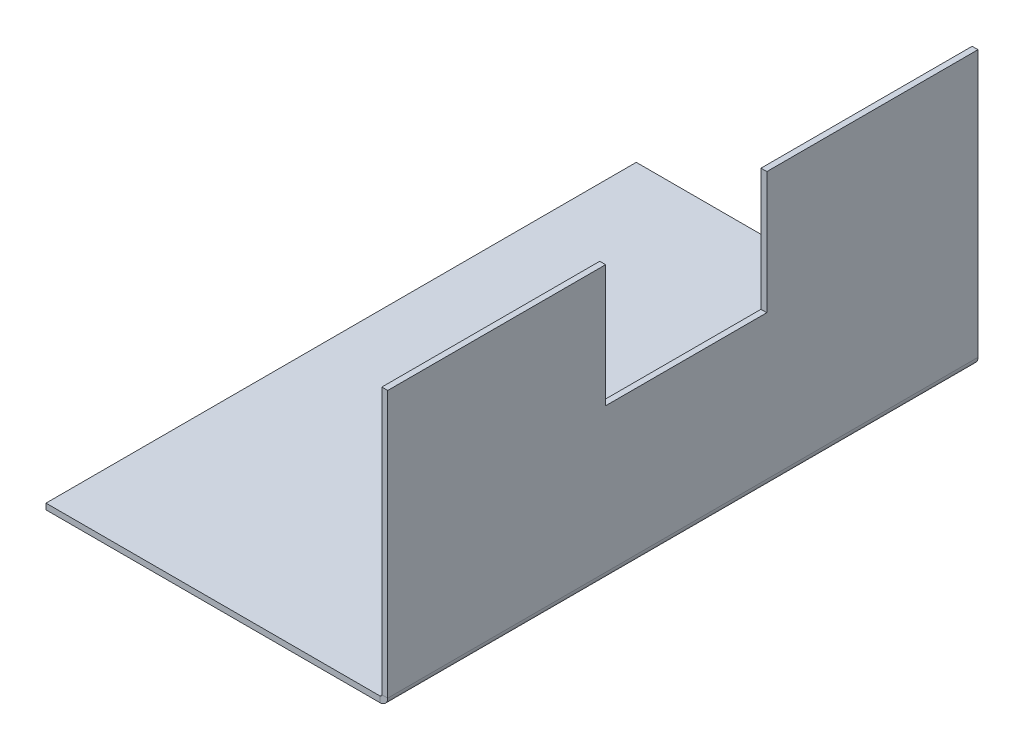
ISO-10303-21;
HEADER;
FILE_DESCRIPTION(('STEP AP214'),'2;1');
FILE_NAME('part.step','',(''),(''),'','','');
FILE_SCHEMA(('AUTOMOTIVE_DESIGN { 1 0 10303 214 1 1 1 1 }'));
ENDSEC;
DATA;
#1=APPLICATION_CONTEXT('core data for automotive mechanical design processes');
#2=APPLICATION_PROTOCOL_DEFINITION('international standard','automotive_design',2000,#1);
#3=PRODUCT_CONTEXT('',#1,'mechanical');
#4=PRODUCT('Part','Part','',(#3));
#5=PRODUCT_RELATED_PRODUCT_CATEGORY('part','',(#4));
#6=PRODUCT_DEFINITION_FORMATION('','',#4);
#7=PRODUCT_DEFINITION_CONTEXT('part definition',#1,'design');
#8=PRODUCT_DEFINITION('design','',#6,#7);
#9=PRODUCT_DEFINITION_SHAPE('','',#8);
#10=(LENGTH_UNIT() NAMED_UNIT(*) SI_UNIT(.MILLI.,.METRE.));
#11=(NAMED_UNIT(*) PLANE_ANGLE_UNIT() SI_UNIT($,.RADIAN.));
#12=(NAMED_UNIT(*) SI_UNIT($,.STERADIAN.) SOLID_ANGLE_UNIT());
#13=UNCERTAINTY_MEASURE_WITH_UNIT(LENGTH_MEASURE(1.E-05),#10,'distance_accuracy_value','');
#14=(GEOMETRIC_REPRESENTATION_CONTEXT(3) GLOBAL_UNCERTAINTY_ASSIGNED_CONTEXT((#13)) GLOBAL_UNIT_ASSIGNED_CONTEXT((#10,
#11,#12)) REPRESENTATION_CONTEXT('',''));
#15=CARTESIAN_POINT('',(0.,0.,0.));
#16=DIRECTION('',(0.,0.,1.));
#17=DIRECTION('',(1.,0.,0.));
#18=AXIS2_PLACEMENT_3D('',#15,#16,#17);
#19=CARTESIAN_POINT('',(0.,0.762,0.));
#20=DIRECTION('',(0.,0.,-1.));
#21=DIRECTION('',(-1.,0.,0.));
#22=AXIS2_PLACEMENT_3D('',#19,#20,#21);
#23=PLANE('',#22);
#24=DIRECTION('',(0.,-1.,0.));
#25=VECTOR('',#24,1.);
#26=CARTESIAN_POINT('',(43.2845731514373,0.761999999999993,0.));
#27=LINE('',#26,#25);
#28=CARTESIAN_POINT('',(43.2845731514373,0.762,0.));
#29=VERTEX_POINT('',#28);
#30=CARTESIAN_POINT('',(43.2845731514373,0.,0.));
#31=VERTEX_POINT('',#30);
#32=EDGE_CURVE('E51',#29,#31,#27,.T.);
#33=ORIENTED_EDGE('',*,*,#32,.F.);
#34=DIRECTION('',(1.,0.,0.));
#35=VECTOR('',#34,1.);
#36=CARTESIAN_POINT('',(0.,0.762,0.));
#37=LINE('',#36,#35);
#38=CARTESIAN_POINT('',(0.,0.762,0.));
#39=VERTEX_POINT('',#38);
#40=EDGE_CURVE('E205',#39,#29,#37,.T.);
#41=ORIENTED_EDGE('',*,*,#40,.F.);
#42=DIRECTION('',(0.,-1.,0.));
#43=VECTOR('',#42,1.);
#44=CARTESIAN_POINT('',(0.,0.762,0.));
#45=LINE('',#44,#43);
#46=CARTESIAN_POINT('',(0.,0.,0.));
#47=VERTEX_POINT('',#46);
#48=EDGE_CURVE('E11',#39,#47,#45,.T.);
#49=ORIENTED_EDGE('',*,*,#48,.T.);
#50=DIRECTION('',(1.,0.,0.));
#51=VECTOR('',#50,1.);
#52=CARTESIAN_POINT('',(0.,0.,0.));
#53=LINE('',#52,#51);
#54=EDGE_CURVE('E198',#47,#31,#53,.T.);
#55=ORIENTED_EDGE('',*,*,#54,.T.);
#56=EDGE_LOOP('',(#33,#41,#49,#55));
#57=FACE_BOUND('',#56,.T.);
#58=ADVANCED_FACE('F28',(#57),#23,.F.);
#59=CARTESIAN_POINT('',(0.,0.762,-76.5167255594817));
#60=DIRECTION('',(0.,0.,1.));
#61=DIRECTION('',(1.,0.,0.));
#62=AXIS2_PLACEMENT_3D('',#59,#60,#61);
#63=PLANE('',#62);
#64=DIRECTION('',(0.,-1.,0.));
#65=VECTOR('',#64,1.);
#66=CARTESIAN_POINT('',(43.2845731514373,0.761999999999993,-76.5167255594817));
#67=LINE('',#66,#65);
#68=CARTESIAN_POINT('',(43.2845731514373,0.762,-76.5167255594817));
#69=VERTEX_POINT('',#68);
#70=CARTESIAN_POINT('',(43.2845731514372,0.,-76.5167255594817));
#71=VERTEX_POINT('',#70);
#72=EDGE_CURVE('E191',#69,#71,#67,.T.);
#73=ORIENTED_EDGE('',*,*,#72,.T.);
#74=DIRECTION('',(-1.,0.,0.));
#75=VECTOR('',#74,1.);
#76=CARTESIAN_POINT('',(0.,0.,-76.5167255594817));
#77=LINE('',#76,#75);
#78=CARTESIAN_POINT('',(0.,0.,-76.5167255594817));
#79=VERTEX_POINT('',#78);
#80=EDGE_CURVE('E200',#71,#79,#77,.T.);
#81=ORIENTED_EDGE('',*,*,#80,.T.);
#82=DIRECTION('',(0.,-1.,0.));
#83=VECTOR('',#82,1.);
#84=CARTESIAN_POINT('',(0.,0.762,-76.5167255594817));
#85=LINE('',#84,#83);
#86=CARTESIAN_POINT('',(0.,0.762,-76.5167255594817));
#87=VERTEX_POINT('',#86);
#88=EDGE_CURVE('E36',#87,#79,#85,.T.);
#89=ORIENTED_EDGE('',*,*,#88,.F.);
#90=DIRECTION('',(-1.,0.,0.));
#91=VECTOR('',#90,1.);
#92=CARTESIAN_POINT('',(0.,0.762,-76.5167255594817));
#93=LINE('',#92,#91);
#94=EDGE_CURVE('E207',#69,#87,#93,.T.);
#95=ORIENTED_EDGE('',*,*,#94,.F.);
#96=EDGE_LOOP('',(#73,#81,#89,#95));
#97=FACE_BOUND('',#96,.T.);
#98=ADVANCED_FACE('F219',(#97),#63,.F.);
#99=CARTESIAN_POINT('',(0.,0.762,0.));
#100=DIRECTION('',(0.,1.,0.));
#101=DIRECTION('',(0.,0.,1.));
#102=AXIS2_PLACEMENT_3D('',#99,#100,#101);
#103=PLANE('',#102);
#104=ORIENTED_EDGE('',*,*,#40,.T.);
#105=DIRECTION('',(0.,0.,-1.));
#106=VECTOR('',#105,1.);
#107=CARTESIAN_POINT('',(43.2845731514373,0.761999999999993,-76.5167255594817));
#108=LINE('',#107,#106);
#109=EDGE_CURVE('E43',#69,#29,#108,.F.);
#110=ORIENTED_EDGE('',*,*,#109,.F.);
#111=ORIENTED_EDGE('',*,*,#94,.T.);
#112=DIRECTION('',(0.,0.,1.));
#113=VECTOR('',#112,1.);
#114=CARTESIAN_POINT('',(0.,0.762,-76.5167255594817));
#115=LINE('',#114,#113);
#116=EDGE_CURVE('E202',#87,#39,#115,.T.);
#117=ORIENTED_EDGE('',*,*,#116,.T.);
#118=EDGE_LOOP('',(#104,#110,#111,#117));
#119=FACE_BOUND('',#118,.T.);
#120=ADVANCED_FACE('F218',(#119),#103,.T.);
#121=CARTESIAN_POINT('',(0.,0.,0.));
#122=DIRECTION('',(0.,1.,0.));
#123=DIRECTION('',(0.,0.,1.));
#124=AXIS2_PLACEMENT_3D('',#121,#122,#123);
#125=PLANE('',#124);
#126=DIRECTION('',(0.,0.,-1.));
#127=VECTOR('',#126,1.);
#128=CARTESIAN_POINT('',(43.2845731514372,0.,-76.5167255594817));
#129=LINE('',#128,#127);
#130=EDGE_CURVE('E125',#71,#31,#129,.F.);
#131=ORIENTED_EDGE('',*,*,#130,.T.);
#132=ORIENTED_EDGE('',*,*,#54,.F.);
#133=DIRECTION('',(0.,0.,1.));
#134=VECTOR('',#133,1.);
#135=CARTESIAN_POINT('',(0.,0.,-76.5167255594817));
#136=LINE('',#135,#134);
#137=EDGE_CURVE('E194',#79,#47,#136,.T.);
#138=ORIENTED_EDGE('',*,*,#137,.F.);
#139=ORIENTED_EDGE('',*,*,#80,.F.);
#140=EDGE_LOOP('',(#131,#132,#138,#139));
#141=FACE_BOUND('',#140,.T.);
#142=ADVANCED_FACE('F217',(#141),#125,.F.);
#143=CARTESIAN_POINT('',(0.,0.762,-76.5167255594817));
#144=DIRECTION('',(1.,0.,0.));
#145=DIRECTION('',(0.,0.,-1.));
#146=AXIS2_PLACEMENT_3D('',#143,#144,#145);
#147=PLANE('',#146);
#148=ORIENTED_EDGE('',*,*,#137,.T.);
#149=ORIENTED_EDGE('',*,*,#48,.F.);
#150=ORIENTED_EDGE('',*,*,#116,.F.);
#151=ORIENTED_EDGE('',*,*,#88,.T.);
#152=EDGE_LOOP('',(#148,#149,#150,#151));
#153=FACE_BOUND('',#152,.T.);
#154=ADVANCED_FACE('F30',(#153),#147,.F.);
#155=CARTESIAN_POINT('',(43.2845731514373,1.016,0.));
#156=DIRECTION('',(0.,0.,1.));
#157=DIRECTION('',(1.,0.,0.));
#158=AXIS2_PLACEMENT_3D('',#155,#156,#157);
#159=PLANE('',#158);
#160=DIRECTION('',(1.,0.,0.));
#161=VECTOR('',#160,1.);
#162=CARTESIAN_POINT('',(43.5385731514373,1.016,0.));
#163=LINE('',#162,#161);
#164=CARTESIAN_POINT('',(43.5385731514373,1.016,0.));
#165=VERTEX_POINT('',#164);
#166=CARTESIAN_POINT('',(44.3005731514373,1.01599999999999,0.));
#167=VERTEX_POINT('',#166);
#168=EDGE_CURVE('E227',#165,#167,#163,.T.);
#169=ORIENTED_EDGE('',*,*,#168,.F.);
#170=CARTESIAN_POINT('',(43.2845731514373,1.016,0.));
#171=DIRECTION('',(0.,0.,-1.));
#172=DIRECTION('',(-1.,0.,0.));
#173=AXIS2_PLACEMENT_3D('',#170,#171,#172);
#174=CIRCLE('',#173,0.254000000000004);
#175=EDGE_CURVE('E128',#29,#165,#174,.F.);
#176=ORIENTED_EDGE('',*,*,#175,.F.);
#177=ORIENTED_EDGE('',*,*,#32,.T.);
#178=CARTESIAN_POINT('',(43.2845731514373,1.016,0.));
#179=DIRECTION('',(0.,0.,-1.));
#180=DIRECTION('',(-1.,0.,0.));
#181=AXIS2_PLACEMENT_3D('',#178,#179,#180);
#182=CIRCLE('',#181,1.016);
#183=EDGE_CURVE('E190',#31,#167,#182,.F.);
#184=ORIENTED_EDGE('',*,*,#183,.T.);
#185=EDGE_LOOP('',(#169,#176,#177,#184));
#186=FACE_BOUND('',#185,.T.);
#187=ADVANCED_FACE('F277',(#186),#159,.T.);
#188=CARTESIAN_POINT('',(43.2845731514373,1.016,-76.5167255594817));
#189=DIRECTION('',(0.,0.,1.));
#190=DIRECTION('',(1.,0.,0.));
#191=AXIS2_PLACEMENT_3D('',#188,#189,#190);
#192=PLANE('',#191);
#193=CARTESIAN_POINT('',(43.2845731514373,1.016,-76.5167255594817));
#194=DIRECTION('',(0.,0.,-1.));
#195=DIRECTION('',(-1.,0.,0.));
#196=AXIS2_PLACEMENT_3D('',#193,#194,#195);
#197=CIRCLE('',#196,0.254000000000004);
#198=CARTESIAN_POINT('',(43.5385731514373,1.016,-76.5167255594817));
#199=VERTEX_POINT('',#198);
#200=EDGE_CURVE('E135',#199,#69,#197,.T.);
#201=ORIENTED_EDGE('',*,*,#200,.F.);
#202=DIRECTION('',(1.,0.,0.));
#203=VECTOR('',#202,1.);
#204=CARTESIAN_POINT('',(43.5385731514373,1.016,-76.5167255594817));
#205=LINE('',#204,#203);
#206=CARTESIAN_POINT('',(44.3005731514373,1.01599999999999,-76.5167255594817));
#207=VERTEX_POINT('',#206);
#208=EDGE_CURVE('E132',#199,#207,#205,.T.);
#209=ORIENTED_EDGE('',*,*,#208,.T.);
#210=CARTESIAN_POINT('',(43.2845731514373,1.016,-76.5167255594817));
#211=DIRECTION('',(0.,0.,-1.));
#212=DIRECTION('',(-1.,0.,0.));
#213=AXIS2_PLACEMENT_3D('',#210,#211,#212);
#214=CIRCLE('',#213,1.016);
#215=EDGE_CURVE('E118',#207,#71,#214,.T.);
#216=ORIENTED_EDGE('',*,*,#215,.T.);
#217=ORIENTED_EDGE('',*,*,#72,.F.);
#218=EDGE_LOOP('',(#201,#209,#216,#217));
#219=FACE_BOUND('',#218,.T.);
#220=ADVANCED_FACE('F133',(#219),#192,.F.);
#221=CARTESIAN_POINT('',(43.2845731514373,1.016,-76.5167255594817));
#222=DIRECTION('',(0.,0.,-1.));
#223=DIRECTION('',(1.,0.,0.));
#224=AXIS2_PLACEMENT_3D('',#221,#222,#223);
#225=CYLINDRICAL_SURFACE('',#224,1.016);
#226=ORIENTED_EDGE('',*,*,#130,.F.);
#227=ORIENTED_EDGE('',*,*,#215,.F.);
#228=DIRECTION('',(0.,0.,1.));
#229=VECTOR('',#228,1.);
#230=CARTESIAN_POINT('',(44.3005731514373,1.01599999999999,0.));
#231=LINE('',#230,#229);
#232=EDGE_CURVE('E123',#207,#167,#231,.T.);
#233=ORIENTED_EDGE('',*,*,#232,.T.);
#234=ORIENTED_EDGE('',*,*,#183,.F.);
#235=EDGE_LOOP('',(#226,#227,#233,#234));
#236=FACE_BOUND('',#235,.T.);
#237=ADVANCED_FACE('F120',(#236),#225,.T.);
#238=CARTESIAN_POINT('',(43.2845731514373,1.016,-76.5167255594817));
#239=DIRECTION('',(0.,0.,-1.));
#240=DIRECTION('',(1.,0.,0.));
#241=AXIS2_PLACEMENT_3D('',#238,#239,#240);
#242=CYLINDRICAL_SURFACE('',#241,0.254000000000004);
#243=ORIENTED_EDGE('',*,*,#109,.T.);
#244=ORIENTED_EDGE('',*,*,#175,.T.);
#245=DIRECTION('',(0.,0.,-1.));
#246=VECTOR('',#245,1.);
#247=CARTESIAN_POINT('',(43.5385731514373,1.016,0.));
#248=LINE('',#247,#246);
#249=EDGE_CURVE('E139',#165,#199,#248,.T.);
#250=ORIENTED_EDGE('',*,*,#249,.T.);
#251=ORIENTED_EDGE('',*,*,#200,.T.);
#252=EDGE_LOOP('',(#243,#244,#250,#251));
#253=FACE_BOUND('',#252,.T.);
#254=ADVANCED_FACE('F221',(#253),#242,.F.);
#255=CARTESIAN_POINT('',(44.3005731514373,0.761999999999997,0.));
#256=DIRECTION('',(0.,0.,-1.));
#257=DIRECTION('',(-1.,0.,0.));
#258=AXIS2_PLACEMENT_3D('',#255,#256,#257);
#259=PLANE('',#258);
#260=ORIENTED_EDGE('',*,*,#168,.T.);
#261=DIRECTION('',(0.,-1.,0.));
#262=VECTOR('',#261,1.);
#263=CARTESIAN_POINT('',(44.3005731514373,0.761999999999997,0.));
#264=LINE('',#263,#262);
#265=CARTESIAN_POINT('',(44.3005731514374,35.56,0.));
#266=VERTEX_POINT('',#265);
#267=EDGE_CURVE('E147',#266,#167,#264,.T.);
#268=ORIENTED_EDGE('',*,*,#267,.F.);
#269=DIRECTION('',(-1.,0.,0.));
#270=VECTOR('',#269,1.);
#271=CARTESIAN_POINT('',(44.3005731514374,35.56,0.));
#272=LINE('',#271,#270);
#273=CARTESIAN_POINT('',(43.5385731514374,35.56,0.));
#274=VERTEX_POINT('',#273);
#275=EDGE_CURVE('E169',#266,#274,#272,.T.);
#276=ORIENTED_EDGE('',*,*,#275,.T.);
#277=DIRECTION('',(0.,-1.,0.));
#278=VECTOR('',#277,1.);
#279=CARTESIAN_POINT('',(43.5385731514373,0.762,0.));
#280=LINE('',#279,#278);
#281=EDGE_CURVE('E148',#274,#165,#280,.T.);
#282=ORIENTED_EDGE('',*,*,#281,.T.);
#283=EDGE_LOOP('',(#260,#268,#276,#282));
#284=FACE_BOUND('',#283,.T.);
#285=ADVANCED_FACE('F250',(#284),#259,.F.);
#286=CARTESIAN_POINT('',(44.3005731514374,35.56,-76.5167255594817));
#287=DIRECTION('',(0.,0.,1.));
#288=DIRECTION('',(1.,0.,0.));
#289=AXIS2_PLACEMENT_3D('',#286,#287,#288);
#290=PLANE('',#289);
#291=ORIENTED_EDGE('',*,*,#208,.F.);
#292=DIRECTION('',(0.,1.,0.));
#293=VECTOR('',#292,1.);
#294=CARTESIAN_POINT('',(43.5385731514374,35.56,-76.5167255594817));
#295=LINE('',#294,#293);
#296=CARTESIAN_POINT('',(43.5385731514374,35.56,-76.5167255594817));
#297=VERTEX_POINT('',#296);
#298=EDGE_CURVE('E233',#199,#297,#295,.T.);
#299=ORIENTED_EDGE('',*,*,#298,.T.);
#300=DIRECTION('',(-1.,0.,0.));
#301=VECTOR('',#300,1.);
#302=CARTESIAN_POINT('',(44.3005731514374,35.56,-76.5167255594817));
#303=LINE('',#302,#301);
#304=CARTESIAN_POINT('',(44.3005731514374,35.56,-76.5167255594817));
#305=VERTEX_POINT('',#304);
#306=EDGE_CURVE('E152',#305,#297,#303,.T.);
#307=ORIENTED_EDGE('',*,*,#306,.F.);
#308=DIRECTION('',(0.,1.,0.));
#309=VECTOR('',#308,1.);
#310=CARTESIAN_POINT('',(44.3005731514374,35.56,-76.5167255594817));
#311=LINE('',#310,#309);
#312=EDGE_CURVE('E144',#207,#305,#311,.T.);
#313=ORIENTED_EDGE('',*,*,#312,.F.);
#314=EDGE_LOOP('',(#291,#299,#307,#313));
#315=FACE_BOUND('',#314,.T.);
#316=ADVANCED_FACE('F150',(#315),#290,.F.);
#317=CARTESIAN_POINT('',(44.3005731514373,0.761999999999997,0.));
#318=DIRECTION('',(-1.,0.,0.));
#319=DIRECTION('',(0.,-1.,0.));
#320=AXIS2_PLACEMENT_3D('',#317,#318,#319);
#321=PLANE('',#320);
#322=ORIENTED_EDGE('',*,*,#232,.F.);
#323=ORIENTED_EDGE('',*,*,#312,.T.);
#324=DIRECTION('',(0.,0.,1.));
#325=VECTOR('',#324,1.);
#326=CARTESIAN_POINT('',(44.3005731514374,35.56,-49.1415153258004));
#327=LINE('',#326,#325);
#328=CARTESIAN_POINT('',(44.3005731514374,35.56,-49.1415153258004));
#329=VERTEX_POINT('',#328);
#330=EDGE_CURVE('E154',#305,#329,#327,.T.);
#331=ORIENTED_EDGE('',*,*,#330,.T.);
#332=DIRECTION('',(0.,-1.,0.));
#333=VECTOR('',#332,1.);
#334=CARTESIAN_POINT('',(44.3005731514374,35.56,-49.1415153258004));
#335=LINE('',#334,#333);
#336=CARTESIAN_POINT('',(44.3005731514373,19.7176850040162,-49.1415153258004));
#337=VERTEX_POINT('',#336);
#338=EDGE_CURVE('E156',#329,#337,#335,.T.);
#339=ORIENTED_EDGE('',*,*,#338,.T.);
#340=DIRECTION('',(0.,0.,1.));
#341=VECTOR('',#340,1.);
#342=CARTESIAN_POINT('',(44.3005731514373,19.7176850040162,-28.2441399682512));
#343=LINE('',#342,#341);
#344=CARTESIAN_POINT('',(44.3005731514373,19.7176850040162,-28.2441399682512));
#345=VERTEX_POINT('',#344);
#346=EDGE_CURVE('E163',#337,#345,#343,.T.);
#347=ORIENTED_EDGE('',*,*,#346,.T.);
#348=DIRECTION('',(0.,1.,0.));
#349=VECTOR('',#348,1.);
#350=CARTESIAN_POINT('',(44.3005731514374,35.56,-28.2441399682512));
#351=LINE('',#350,#349);
#352=CARTESIAN_POINT('',(44.3005731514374,35.56,-28.2441399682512));
#353=VERTEX_POINT('',#352);
#354=EDGE_CURVE('E165',#345,#353,#351,.T.);
#355=ORIENTED_EDGE('',*,*,#354,.T.);
#356=DIRECTION('',(0.,0.,1.));
#357=VECTOR('',#356,1.);
#358=CARTESIAN_POINT('',(44.3005731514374,35.56,0.));
#359=LINE('',#358,#357);
#360=EDGE_CURVE('E167',#353,#266,#359,.T.);
#361=ORIENTED_EDGE('',*,*,#360,.T.);
#362=ORIENTED_EDGE('',*,*,#267,.T.);
#363=EDGE_LOOP('',(#322,#323,#331,#339,#347,#355,#361,#362));
#364=FACE_BOUND('',#363,.T.);
#365=ADVANCED_FACE('F143',(#364),#321,.F.);
#366=CARTESIAN_POINT('',(43.5385731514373,0.762,0.));
#367=DIRECTION('',(-1.,0.,0.));
#368=DIRECTION('',(0.,-1.,0.));
#369=AXIS2_PLACEMENT_3D('',#366,#367,#368);
#370=PLANE('',#369);
#371=ORIENTED_EDGE('',*,*,#298,.F.);
#372=ORIENTED_EDGE('',*,*,#249,.F.);
#373=ORIENTED_EDGE('',*,*,#281,.F.);
#374=DIRECTION('',(0.,0.,1.));
#375=VECTOR('',#374,1.);
#376=CARTESIAN_POINT('',(43.5385731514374,35.56,0.));
#377=LINE('',#376,#375);
#378=CARTESIAN_POINT('',(43.5385731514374,35.56,-28.2441399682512));
#379=VERTEX_POINT('',#378);
#380=EDGE_CURVE('E158',#379,#274,#377,.T.);
#381=ORIENTED_EDGE('',*,*,#380,.F.);
#382=DIRECTION('',(0.,1.,0.));
#383=VECTOR('',#382,1.);
#384=CARTESIAN_POINT('',(43.5385731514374,35.56,-28.2441399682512));
#385=LINE('',#384,#383);
#386=CARTESIAN_POINT('',(43.5385731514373,19.7176850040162,-28.2441399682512));
#387=VERTEX_POINT('',#386);
#388=EDGE_CURVE('E241',#387,#379,#385,.T.);
#389=ORIENTED_EDGE('',*,*,#388,.F.);
#390=DIRECTION('',(0.,0.,1.));
#391=VECTOR('',#390,1.);
#392=CARTESIAN_POINT('',(43.5385731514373,19.7176850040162,-28.2441399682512));
#393=LINE('',#392,#391);
#394=CARTESIAN_POINT('',(43.5385731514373,19.7176850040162,-49.1415153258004));
#395=VERTEX_POINT('',#394);
#396=EDGE_CURVE('E239',#395,#387,#393,.T.);
#397=ORIENTED_EDGE('',*,*,#396,.F.);
#398=DIRECTION('',(0.,-1.,0.));
#399=VECTOR('',#398,1.);
#400=CARTESIAN_POINT('',(43.5385731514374,35.56,-49.1415153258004));
#401=LINE('',#400,#399);
#402=CARTESIAN_POINT('',(43.5385731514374,35.56,-49.1415153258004));
#403=VERTEX_POINT('',#402);
#404=EDGE_CURVE('E237',#403,#395,#401,.T.);
#405=ORIENTED_EDGE('',*,*,#404,.F.);
#406=DIRECTION('',(0.,0.,1.));
#407=VECTOR('',#406,1.);
#408=CARTESIAN_POINT('',(43.5385731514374,35.56,-49.1415153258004));
#409=LINE('',#408,#407);
#410=EDGE_CURVE('E235',#297,#403,#409,.T.);
#411=ORIENTED_EDGE('',*,*,#410,.F.);
#412=EDGE_LOOP('',(#371,#372,#373,#381,#389,#397,#405,#411));
#413=FACE_BOUND('',#412,.T.);
#414=ADVANCED_FACE('F251',(#413),#370,.T.);
#415=CARTESIAN_POINT('',(44.3005731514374,35.56,-49.1415153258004));
#416=DIRECTION('',(0.,-1.,0.));
#417=DIRECTION('',(1.,0.,0.));
#418=AXIS2_PLACEMENT_3D('',#415,#416,#417);
#419=PLANE('',#418);
#420=ORIENTED_EDGE('',*,*,#410,.T.);
#421=DIRECTION('',(-1.,0.,0.));
#422=VECTOR('',#421,1.);
#423=CARTESIAN_POINT('',(44.3005731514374,35.56,-49.1415153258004));
#424=LINE('',#423,#422);
#425=EDGE_CURVE('E181',#329,#403,#424,.T.);
#426=ORIENTED_EDGE('',*,*,#425,.F.);
#427=ORIENTED_EDGE('',*,*,#330,.F.);
#428=ORIENTED_EDGE('',*,*,#306,.T.);
#429=EDGE_LOOP('',(#420,#426,#427,#428));
#430=FACE_BOUND('',#429,.T.);
#431=ADVANCED_FACE('F254',(#430),#419,.F.);
#432=CARTESIAN_POINT('',(44.3005731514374,35.56,-49.1415153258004));
#433=DIRECTION('',(0.,0.,-1.));
#434=DIRECTION('',(-1.,0.,0.));
#435=AXIS2_PLACEMENT_3D('',#432,#433,#434);
#436=PLANE('',#435);
#437=ORIENTED_EDGE('',*,*,#404,.T.);
#438=DIRECTION('',(-1.,0.,0.));
#439=VECTOR('',#438,1.);
#440=CARTESIAN_POINT('',(44.3005731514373,19.7176850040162,-49.1415153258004));
#441=LINE('',#440,#439);
#442=EDGE_CURVE('E178',#337,#395,#441,.T.);
#443=ORIENTED_EDGE('',*,*,#442,.F.);
#444=ORIENTED_EDGE('',*,*,#338,.F.);
#445=ORIENTED_EDGE('',*,*,#425,.T.);
#446=EDGE_LOOP('',(#437,#443,#444,#445));
#447=FACE_BOUND('',#446,.T.);
#448=ADVANCED_FACE('F260',(#447),#436,.F.);
#449=CARTESIAN_POINT('',(44.3005731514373,19.7176850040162,-28.2441399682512));
#450=DIRECTION('',(0.,-1.,0.));
#451=DIRECTION('',(1.,0.,0.));
#452=AXIS2_PLACEMENT_3D('',#449,#450,#451);
#453=PLANE('',#452);
#454=ORIENTED_EDGE('',*,*,#396,.T.);
#455=DIRECTION('',(-1.,0.,0.));
#456=VECTOR('',#455,1.);
#457=CARTESIAN_POINT('',(44.3005731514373,19.7176850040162,-28.2441399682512));
#458=LINE('',#457,#456);
#459=EDGE_CURVE('E175',#345,#387,#458,.T.);
#460=ORIENTED_EDGE('',*,*,#459,.F.);
#461=ORIENTED_EDGE('',*,*,#346,.F.);
#462=ORIENTED_EDGE('',*,*,#442,.T.);
#463=EDGE_LOOP('',(#454,#460,#461,#462));
#464=FACE_BOUND('',#463,.T.);
#465=ADVANCED_FACE('F291',(#464),#453,.F.);
#466=CARTESIAN_POINT('',(44.3005731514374,35.56,-28.2441399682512));
#467=DIRECTION('',(0.,0.,1.));
#468=DIRECTION('',(1.,0.,0.));
#469=AXIS2_PLACEMENT_3D('',#466,#467,#468);
#470=PLANE('',#469);
#471=ORIENTED_EDGE('',*,*,#388,.T.);
#472=DIRECTION('',(-1.,0.,0.));
#473=VECTOR('',#472,1.);
#474=CARTESIAN_POINT('',(44.3005731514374,35.56,-28.2441399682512));
#475=LINE('',#474,#473);
#476=EDGE_CURVE('E172',#353,#379,#475,.T.);
#477=ORIENTED_EDGE('',*,*,#476,.F.);
#478=ORIENTED_EDGE('',*,*,#354,.F.);
#479=ORIENTED_EDGE('',*,*,#459,.T.);
#480=EDGE_LOOP('',(#471,#477,#478,#479));
#481=FACE_BOUND('',#480,.T.);
#482=ADVANCED_FACE('F295',(#481),#470,.F.);
#483=CARTESIAN_POINT('',(44.3005731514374,35.56,0.));
#484=DIRECTION('',(0.,-1.,0.));
#485=DIRECTION('',(1.,0.,0.));
#486=AXIS2_PLACEMENT_3D('',#483,#484,#485);
#487=PLANE('',#486);
#488=ORIENTED_EDGE('',*,*,#380,.T.);
#489=ORIENTED_EDGE('',*,*,#275,.F.);
#490=ORIENTED_EDGE('',*,*,#360,.F.);
#491=ORIENTED_EDGE('',*,*,#476,.T.);
#492=EDGE_LOOP('',(#488,#489,#490,#491));
#493=FACE_BOUND('',#492,.T.);
#494=ADVANCED_FACE('F245',(#493),#487,.F.);
#495=CLOSED_SHELL('',(#58,#98,#120,#142,#154,#187,#220,#237,#254,#285,#316,#365,#414,#431,#448,
#465,#482,#494));
#496=MANIFOLD_SOLID_BREP('B2',#495);
#497=ADVANCED_BREP_SHAPE_REPRESENTATION('',(#18,#496),#14);
#498=SHAPE_DEFINITION_REPRESENTATION(#9,#497);
ENDSEC;
END-ISO-10303-21;
